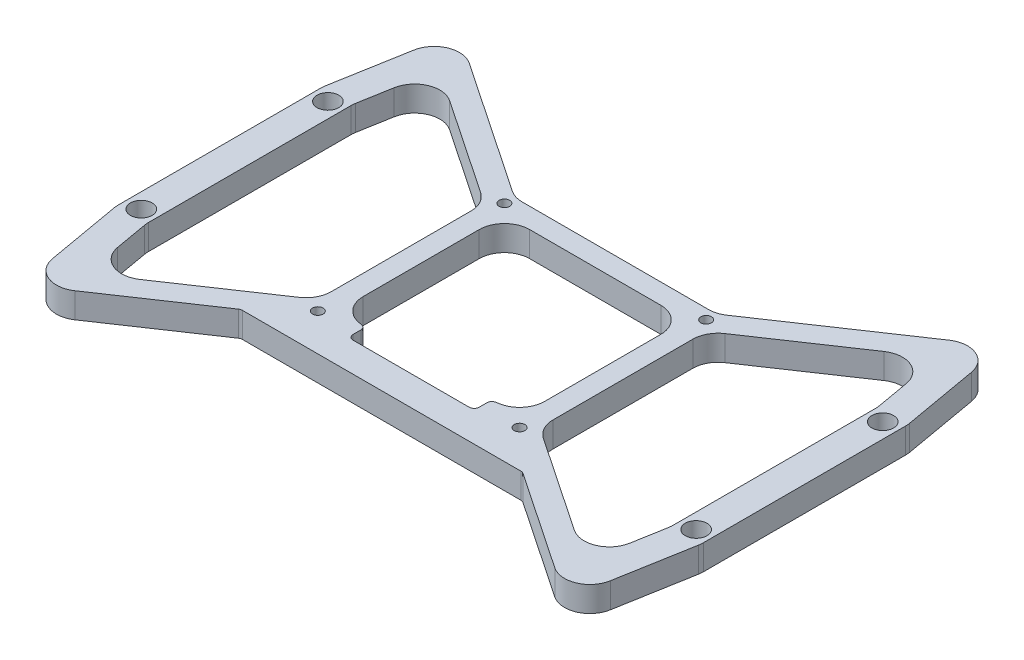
from build123d import *

# Parameters (mm, degrees)
SKETCH1_R           = 2.15
SKETCH1_R_2         = 1.05
SKETCH1_W           = 4
SKETCH1_H           = 33
BOSS_EXTRUDE1_DEPTH = 5
FILLET1_R           = 5
SKETCH2_W           = 25
SKETCH2_H           = 3.5
CUT_EXTRUDE1_DEPTH  = 71.602680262
SKETCH3_W           = 55.867355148
SKETCH3_H           = 5.348236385
BOSS_EXTRUDE2_DEPTH = 5
FILLET2_R           = 1


with BuildPart() as part:
    # Sketch1 → Boss-Extrude1 (new body)
    # profile 1 of 3: a face of its own
    with BuildSketch(Plane(origin=(0, 0, 0), x_dir=(1, 0, 0), z_dir=(0, 1, 0))):
        Polygon((-58, 20.5), (-58, -20.5), (-53.962982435, -43.395064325), (-20, -20.5), (20, -20.5), (53.962982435, -43.395064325), (58, -20.5), (58, 20.5), (53.962982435, 43.395064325), (20, 20.5), (-20, 20.5), (-53.962982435, 43.395064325), align=None)
        with Locations(Location((55, 18.5, 0), (0, 0, 270))):
            Circle(SKETCH1_R, mode=Mode.SUBTRACT)
        with Locations(Location((55, -18.5, 0), (0, 0, 270))):
            Circle(SKETCH1_R, mode=Mode.SUBTRACT)
        with Locations(Location((-55, -18.5, 0), (0, 0, 270))):
            Circle(SKETCH1_R, mode=Mode.SUBTRACT)
        with Locations(Location((-55, 18.5, 0), (0, 0, 270))):
            Circle(SKETCH1_R, mode=Mode.SUBTRACT)
        with Locations(Location((-20, -18.5, 0), (0, 0, 270))):
            Circle(SKETCH1_R_2, mode=Mode.SUBTRACT)
        with Locations(Location((20, -18.5, 0), (0, 0, 270))):
            Circle(SKETCH1_R_2, mode=Mode.SUBTRACT)
        with Locations(Location((20, 18.5, 0), (0, 0, 270))):
            Circle(SKETCH1_R_2, mode=Mode.SUBTRACT)
        with Locations(Location((-20, 18.5, 0), (0, 0, 270))):
            Circle(SKETCH1_R_2, mode=Mode.SUBTRACT)
        Polygon((-22, -16.5), (-49.44325878, -35), (-52, -20.5), (-52, 20.5), (-49.44325878, 35), (-22, 16.5), (22, 16.5), (49.44325878, 35), (52, 20.5), (52, -20.5), (49.44325878, -35), (22, -16.5), align=None, mode=Mode.SUBTRACT)
    # profile 2 of 3: a face of its own
    with BuildSketch(Plane(origin=(0, 0, 0), x_dir=(1, 0, 0), z_dir=(0, 1, 0))):
        with Locations((-20, 0)):
            Rectangle(SKETCH1_W, SKETCH1_H)
    # profile 3 of 3: a face of its own
    with BuildSketch(Plane(origin=(0, 0, 0), x_dir=(1, 0, 0), z_dir=(0, 1, 0))):
        with Locations((20, 0)):
            Rectangle(SKETCH1_W, SKETCH1_H)
    extrude(amount=BOSS_EXTRUDE1_DEPTH)

    # Fillet1
    fillet1_edges = [part.edges().sort_by_distance(p)[0] for p in [
        (-58, 2.5, -20.5),
        (-53.962982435, 2.5, -43.395064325),
        (-20, 2.5, -20.5),
        (20, 2.5, -20.5),
        (53.962982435, 2.5, -43.395064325),
        (58, 2.5, -20.5),
        (58, 2.5, 20.5),
        (53.962982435, 2.5, 43.395064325),
        (20, 2.5, 20.5),
        (-20, 2.5, 20.5),
        (-53.962982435, 2.5, 43.395064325),
        (-58, 2.5, 20.5),
        (22, 2.5, 16.5),
        (49.44325878, 2.5, 35),
        (52, 2.5, 20.5),
        (52, 2.5, -20.5),
        (49.44325878, 2.5, -35),
        (22, 2.5, -16.5),
        (-49.44325878, 2.5, -35),
        (-52, 2.5, -20.5),
        (-52, 2.5, 20.5),
        (-49.44325878, 2.5, 35),
        (-22, 2.5, 16.5),
        (-22, 2.5, -16.5),
        (-18, 2.5, -16.5),
        (-18, 2.5, 16.5),
        (18, 2.5, 16.5),
        (18, 2.5, -16.5),
    ]]
    fillet(fillet1_edges, radius=FILLET1_R)

    # Sketch2 → Cut-Extrude1 (cut, through all)
    with BuildSketch(Plane(origin=(0, 5, 0), x_dir=(1, 0, 0), z_dir=(0, 1, 0))):
        with Locations((0, -18.25)):
            Rectangle(SKETCH2_W, SKETCH2_H)
    extrude(amount=-CUT_EXTRUDE1_DEPTH, mode=Mode.SUBTRACT)

    # Sketch3 → Boss-Extrude2 (add)
    with BuildSketch(Plane(origin=(0, 5, 0), x_dir=(1, 0, 0), z_dir=(0, 1, 0))):
        with Locations((0, -23.174118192)):
            Rectangle(SKETCH3_W, SKETCH3_H)
    extrude(amount=-BOSS_EXTRUDE2_DEPTH)

    # Fillet2
    fillet2_edges = [part.edges().sort_by_distance(p)[0] for p in [
        (27.933677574, 2.5, 25.848236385),
        (-27.933677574, 2.5, 25.848236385),
        (-12.5, 2.5, 16.5),
        (-12.5, 2.5, 20),
        (12.5, 2.5, 20),
        (12.5, 2.5, 16.5),
    ]]
    fillet(fillet2_edges, radius=FILLET2_R)


solid = part.part
